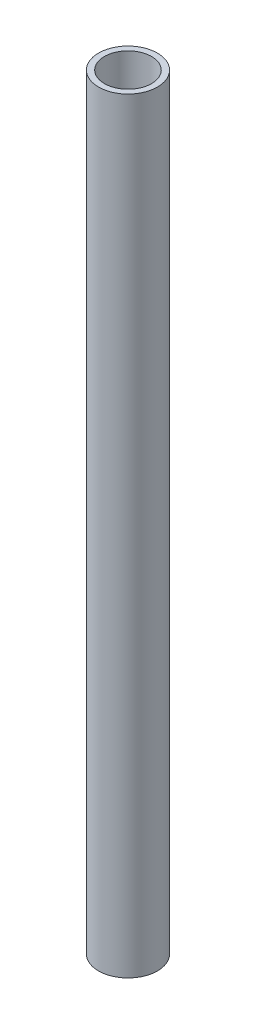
from build123d import *

# Parameters (mm, degrees)
SKETCH1_R           = 10
SKETCH1_R_2         = 8
BOSS_EXTRUDE1_DEPTH = 260


with BuildPart() as part:
    # Sketch1 → Boss-Extrude1 (new body)
    with BuildSketch(Plane(origin=(0, 0, 0), x_dir=(1, 0, 0), z_dir=(0, 1, 0))):
        with Locations(Location((0, 0, 0), (0, 0, 270))):
            Circle(SKETCH1_R)
        with Locations(Location((0, 0, 0), (0, 0, 270))):
            Circle(SKETCH1_R_2, mode=Mode.SUBTRACT)
    extrude(amount=BOSS_EXTRUDE1_DEPTH)


solid = part.part
